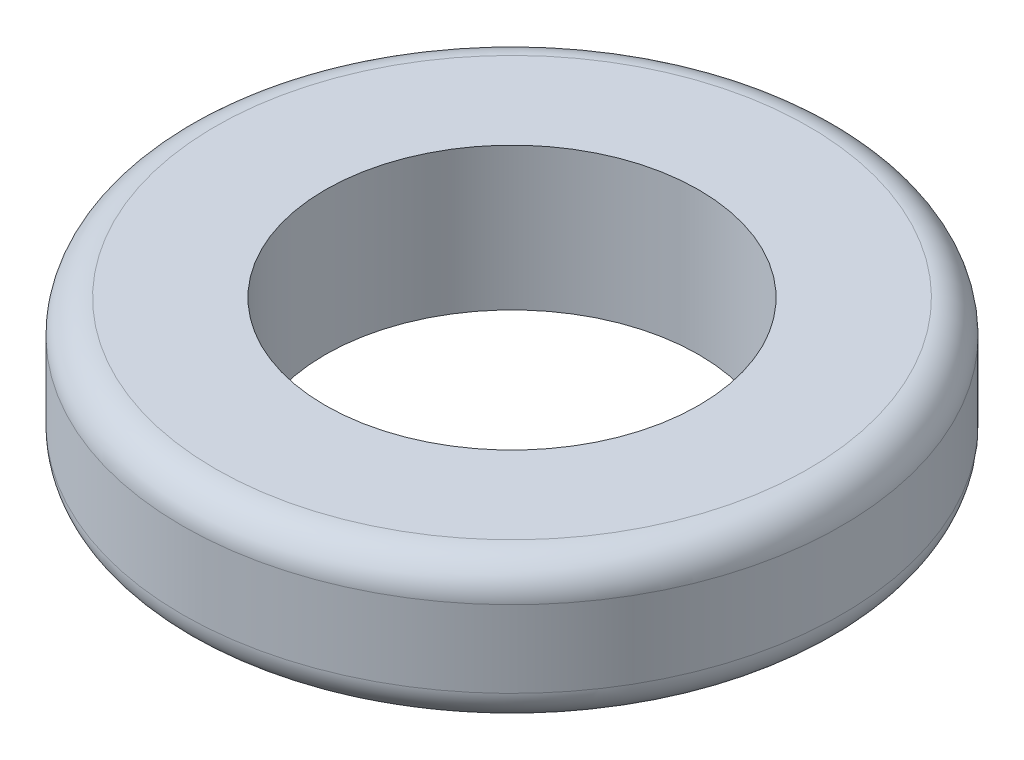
ISO-10303-21;
HEADER;
FILE_DESCRIPTION(('STEP AP214'),'2;1');
FILE_NAME('part.step','',(''),(''),'','','');
FILE_SCHEMA(('AUTOMOTIVE_DESIGN { 1 0 10303 214 1 1 1 1 }'));
ENDSEC;
DATA;
#1=APPLICATION_CONTEXT('core data for automotive mechanical design processes');
#2=APPLICATION_PROTOCOL_DEFINITION('international standard','automotive_design',2000,#1);
#3=PRODUCT_CONTEXT('',#1,'mechanical');
#4=PRODUCT('Part','Part','',(#3));
#5=PRODUCT_RELATED_PRODUCT_CATEGORY('part','',(#4));
#6=PRODUCT_DEFINITION_FORMATION('','',#4);
#7=PRODUCT_DEFINITION_CONTEXT('part definition',#1,'design');
#8=PRODUCT_DEFINITION('design','',#6,#7);
#9=PRODUCT_DEFINITION_SHAPE('','',#8);
#10=(LENGTH_UNIT() NAMED_UNIT(*) SI_UNIT(.MILLI.,.METRE.));
#11=(NAMED_UNIT(*) PLANE_ANGLE_UNIT() SI_UNIT($,.RADIAN.));
#12=(NAMED_UNIT(*) SI_UNIT($,.STERADIAN.) SOLID_ANGLE_UNIT());
#13=UNCERTAINTY_MEASURE_WITH_UNIT(LENGTH_MEASURE(1.E-05),#10,'distance_accuracy_value','');
#14=(GEOMETRIC_REPRESENTATION_CONTEXT(3) GLOBAL_UNCERTAINTY_ASSIGNED_CONTEXT((#13)) GLOBAL_UNIT_ASSIGNED_CONTEXT((#10,
#11,#12)) REPRESENTATION_CONTEXT('',''));
#15=CARTESIAN_POINT('',(0.,0.,0.));
#16=DIRECTION('',(0.,0.,1.));
#17=DIRECTION('',(1.,0.,0.));
#18=AXIS2_PLACEMENT_3D('',#15,#16,#17);
#19=CARTESIAN_POINT('',(0.,3.3,0.));
#20=DIRECTION('',(0.,1.,0.));
#21=DIRECTION('',(0.,0.,1.));
#22=AXIS2_PLACEMENT_3D('',#19,#20,#21);
#23=PLANE('',#22);
#24=CARTESIAN_POINT('',(0.,3.3,0.));
#25=DIRECTION('',(0.,1.,0.));
#26=DIRECTION('',(0.,0.,1.));
#27=AXIS2_PLACEMENT_3D('',#24,#25,#26);
#28=CIRCLE('',#27,6.858);
#29=CARTESIAN_POINT('',(0.,3.3,6.858));
#30=VERTEX_POINT('',#29);
#31=EDGE_CURVE('E10',#30,#30,#28,.T.);
#32=ORIENTED_EDGE('',*,*,#31,.T.);
#33=EDGE_LOOP('',(#32));
#34=FACE_BOUND('',#33,.T.);
#35=CARTESIAN_POINT('',(0.,3.3,0.));
#36=DIRECTION('',(0.,1.,0.));
#37=DIRECTION('',(0.,0.,1.));
#38=AXIS2_PLACEMENT_3D('',#35,#36,#37);
#39=CIRCLE('',#38,4.318);
#40=CARTESIAN_POINT('',(0.,3.3,4.318));
#41=VERTEX_POINT('',#40);
#42=EDGE_CURVE('E51',#41,#41,#39,.T.);
#43=ORIENTED_EDGE('',*,*,#42,.F.);
#44=EDGE_LOOP('',(#43));
#45=FACE_BOUND('',#44,.T.);
#46=ADVANCED_FACE('F31',(#34,#45),#23,.T.);
#47=CARTESIAN_POINT('',(0.,0.,0.));
#48=DIRECTION('',(0.,1.,0.));
#49=DIRECTION('',(0.,0.,1.));
#50=AXIS2_PLACEMENT_3D('',#47,#48,#49);
#51=PLANE('',#50);
#52=CARTESIAN_POINT('',(0.,0.,0.));
#53=DIRECTION('',(0.,1.,0.));
#54=DIRECTION('',(0.,0.,1.));
#55=AXIS2_PLACEMENT_3D('',#52,#53,#54);
#56=CIRCLE('',#55,6.858);
#57=CARTESIAN_POINT('',(0.,0.,6.858));
#58=VERTEX_POINT('',#57);
#59=EDGE_CURVE('E38',#58,#58,#56,.F.);
#60=ORIENTED_EDGE('',*,*,#59,.T.);
#61=EDGE_LOOP('',(#60));
#62=FACE_BOUND('',#61,.T.);
#63=CARTESIAN_POINT('',(0.,0.,0.));
#64=DIRECTION('',(0.,1.,0.));
#65=DIRECTION('',(0.,0.,1.));
#66=AXIS2_PLACEMENT_3D('',#63,#64,#65);
#67=CIRCLE('',#66,4.318);
#68=CARTESIAN_POINT('',(0.,0.,4.318));
#69=VERTEX_POINT('',#68);
#70=EDGE_CURVE('E52',#69,#69,#67,.T.);
#71=ORIENTED_EDGE('',*,*,#70,.T.);
#72=EDGE_LOOP('',(#71));
#73=FACE_BOUND('',#72,.T.);
#74=ADVANCED_FACE('F62',(#62,#73),#51,.F.);
#75=CARTESIAN_POINT('',(0.,3.3,0.));
#76=DIRECTION('',(0.,-1.,0.));
#77=DIRECTION('',(0.,0.,-1.));
#78=AXIS2_PLACEMENT_3D('',#75,#76,#77);
#79=CYLINDRICAL_SURFACE('',#78,7.62);
#80=CARTESIAN_POINT('',(0.,0.762,0.));
#81=DIRECTION('',(0.,1.,0.));
#82=DIRECTION('',(0.,0.,1.));
#83=AXIS2_PLACEMENT_3D('',#80,#81,#82);
#84=CIRCLE('',#83,7.62);
#85=CARTESIAN_POINT('',(0.,0.762,7.62));
#86=VERTEX_POINT('',#85);
#87=EDGE_CURVE('E42',#86,#86,#84,.T.);
#88=ORIENTED_EDGE('',*,*,#87,.T.);
#89=EDGE_LOOP('',(#88));
#90=FACE_BOUND('',#89,.T.);
#91=CARTESIAN_POINT('',(0.,2.538,0.));
#92=DIRECTION('',(0.,1.,0.));
#93=DIRECTION('',(0.,0.,1.));
#94=AXIS2_PLACEMENT_3D('',#91,#92,#93);
#95=CIRCLE('',#94,7.62);
#96=CARTESIAN_POINT('',(0.,2.538,7.62));
#97=VERTEX_POINT('',#96);
#98=EDGE_CURVE('E46',#97,#97,#95,.F.);
#99=ORIENTED_EDGE('',*,*,#98,.T.);
#100=EDGE_LOOP('',(#99));
#101=FACE_BOUND('',#100,.T.);
#102=ADVANCED_FACE('F67',(#90,#101),#79,.T.);
#103=CARTESIAN_POINT('',(0.,3.3,0.));
#104=DIRECTION('',(0.,-1.,0.));
#105=DIRECTION('',(0.,0.,-1.));
#106=AXIS2_PLACEMENT_3D('',#103,#104,#105);
#107=CYLINDRICAL_SURFACE('',#106,4.318);
#108=ORIENTED_EDGE('',*,*,#42,.T.);
#109=EDGE_LOOP('',(#108));
#110=FACE_BOUND('',#109,.T.);
#111=ORIENTED_EDGE('',*,*,#70,.F.);
#112=EDGE_LOOP('',(#111));
#113=FACE_BOUND('',#112,.T.);
#114=ADVANCED_FACE('F58',(#110,#113),#107,.F.);
#115=CARTESIAN_POINT('',(0.,0.762,0.));
#116=DIRECTION('',(0.,1.,0.));
#117=DIRECTION('',(0.,0.,1.));
#118=AXIS2_PLACEMENT_3D('',#115,#116,#117);
#119=TOROIDAL_SURFACE('',#118,6.858,0.762);
#120=ORIENTED_EDGE('',*,*,#59,.F.);
#121=EDGE_LOOP('',(#120));
#122=FACE_BOUND('',#121,.T.);
#123=ORIENTED_EDGE('',*,*,#87,.F.);
#124=EDGE_LOOP('',(#123));
#125=FACE_BOUND('',#124,.T.);
#126=ADVANCED_FACE('F73',(#122,#125),#119,.T.);
#127=CARTESIAN_POINT('',(0.,2.538,0.));
#128=DIRECTION('',(0.,1.,0.));
#129=DIRECTION('',(0.,0.,1.));
#130=AXIS2_PLACEMENT_3D('',#127,#128,#129);
#131=TOROIDAL_SURFACE('',#130,6.858,0.762);
#132=ORIENTED_EDGE('',*,*,#98,.F.);
#133=EDGE_LOOP('',(#132));
#134=FACE_BOUND('',#133,.T.);
#135=ORIENTED_EDGE('',*,*,#31,.F.);
#136=EDGE_LOOP('',(#135));
#137=FACE_BOUND('',#136,.T.);
#138=ADVANCED_FACE('F33',(#134,#137),#131,.T.);
#139=CLOSED_SHELL('',(#46,#74,#102,#114,#126,#138));
#140=MANIFOLD_SOLID_BREP('B2',#139);
#141=ADVANCED_BREP_SHAPE_REPRESENTATION('',(#18,#140),#14);
#142=SHAPE_DEFINITION_REPRESENTATION(#9,#141);
ENDSEC;
END-ISO-10303-21;
